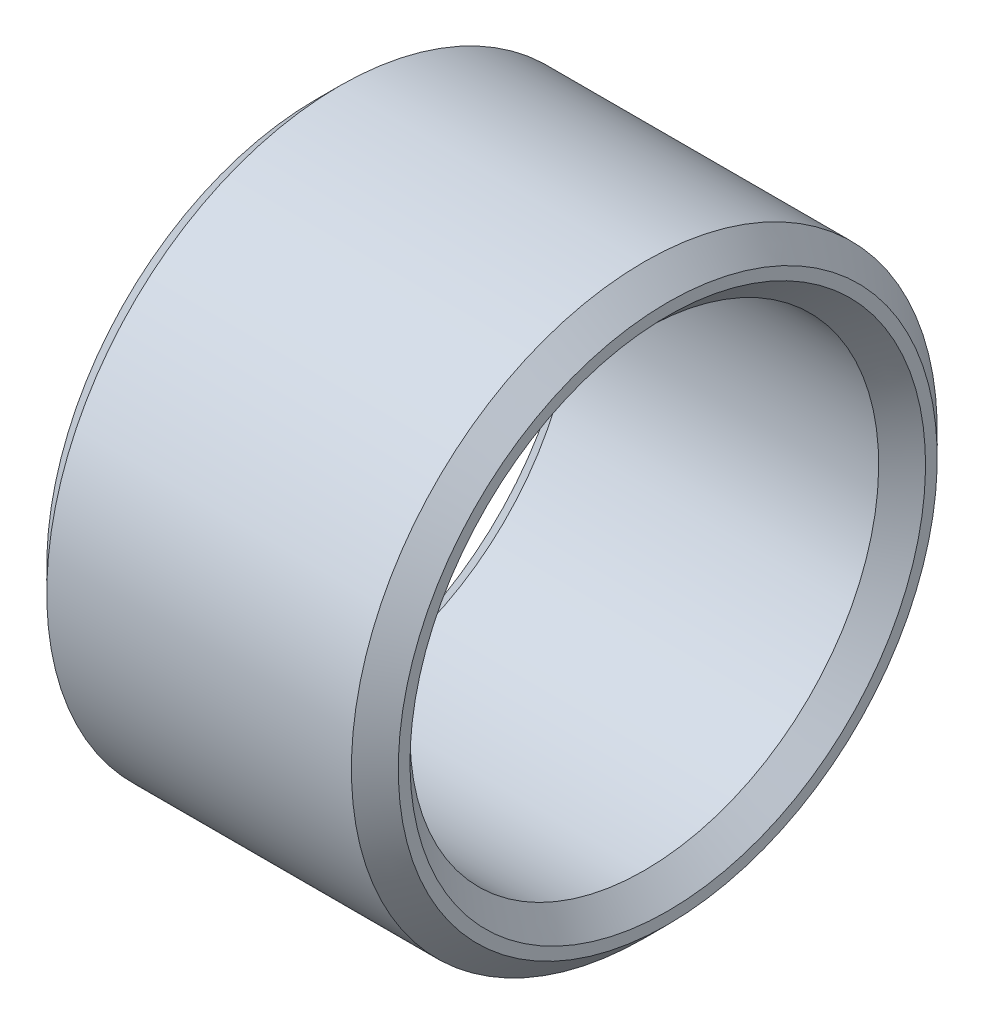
ISO-10303-21;
HEADER;
FILE_DESCRIPTION(('STEP AP214'),'2;1');
FILE_NAME('part.step','',(''),(''),'','','');
FILE_SCHEMA(('AUTOMOTIVE_DESIGN { 1 0 10303 214 1 1 1 1 }'));
ENDSEC;
DATA;
#1=APPLICATION_CONTEXT('core data for automotive mechanical design processes');
#2=APPLICATION_PROTOCOL_DEFINITION('international standard','automotive_design',2000,#1);
#3=PRODUCT_CONTEXT('',#1,'mechanical');
#4=PRODUCT('Part','Part','',(#3));
#5=PRODUCT_RELATED_PRODUCT_CATEGORY('part','',(#4));
#6=PRODUCT_DEFINITION_FORMATION('','',#4);
#7=PRODUCT_DEFINITION_CONTEXT('part definition',#1,'design');
#8=PRODUCT_DEFINITION('design','',#6,#7);
#9=PRODUCT_DEFINITION_SHAPE('','',#8);
#10=(LENGTH_UNIT() NAMED_UNIT(*) SI_UNIT(.MILLI.,.METRE.));
#11=(NAMED_UNIT(*) PLANE_ANGLE_UNIT() SI_UNIT($,.RADIAN.));
#12=(NAMED_UNIT(*) SI_UNIT($,.STERADIAN.) SOLID_ANGLE_UNIT());
#13=UNCERTAINTY_MEASURE_WITH_UNIT(LENGTH_MEASURE(1.E-05),#10,'distance_accuracy_value','');
#14=(GEOMETRIC_REPRESENTATION_CONTEXT(3) GLOBAL_UNCERTAINTY_ASSIGNED_CONTEXT((#13)) GLOBAL_UNIT_ASSIGNED_CONTEXT((#10,
#11,#12)) REPRESENTATION_CONTEXT('',''));
#15=CARTESIAN_POINT('',(0.,0.,0.));
#16=DIRECTION('',(0.,0.,1.));
#17=DIRECTION('',(1.,0.,0.));
#18=AXIS2_PLACEMENT_3D('',#15,#16,#17);
#19=CARTESIAN_POINT('',(0.,-4.5,0.));
#20=DIRECTION('',(-1.,0.,0.));
#21=DIRECTION('',(0.,1.,0.));
#22=AXIS2_PLACEMENT_3D('',#19,#20,#21);
#23=PLANE('',#22);
#24=CARTESIAN_POINT('',(0.,0.,0.));
#25=DIRECTION('',(1.,0.,0.));
#26=DIRECTION('',(0.,-1.,0.));
#27=AXIS2_PLACEMENT_3D('',#24,#25,#26);
#28=CIRCLE('',#27,4.4);
#29=CARTESIAN_POINT('',(0.,-4.4,0.));
#30=VERTEX_POINT('',#29);
#31=EDGE_CURVE('E9',#30,#30,#28,.T.);
#32=ORIENTED_EDGE('',*,*,#31,.T.);
#33=EDGE_LOOP('',(#32));
#34=FACE_BOUND('',#33,.T.);
#35=CARTESIAN_POINT('',(0.,0.,0.));
#36=DIRECTION('',(1.,0.,0.));
#37=DIRECTION('',(0.,-1.,0.));
#38=AXIS2_PLACEMENT_3D('',#35,#36,#37);
#39=CIRCLE('',#38,4.6);
#40=CARTESIAN_POINT('',(0.,-4.6,0.));
#41=VERTEX_POINT('',#40);
#42=EDGE_CURVE('E59',#41,#41,#39,.T.);
#43=ORIENTED_EDGE('',*,*,#42,.F.);
#44=EDGE_LOOP('',(#43));
#45=FACE_BOUND('',#44,.T.);
#46=ADVANCED_FACE('F15',(#34,#45),#23,.T.);
#47=CARTESIAN_POINT('',(0.2,0.,0.));
#48=DIRECTION('',(-1.,0.,0.));
#49=DIRECTION('',(0.,-1.,0.));
#50=AXIS2_PLACEMENT_3D('',#47,#48,#49);
#51=CONICAL_SURFACE('',#50,4.2,0.785398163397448);
#52=CARTESIAN_POINT('',(0.4,0.,0.));
#53=DIRECTION('',(1.,0.,0.));
#54=DIRECTION('',(0.,-1.,0.));
#55=AXIS2_PLACEMENT_3D('',#52,#53,#54);
#56=CIRCLE('',#55,4.);
#57=CARTESIAN_POINT('',(0.4,-4.,0.));
#58=VERTEX_POINT('',#57);
#59=EDGE_CURVE('E24',#58,#58,#56,.T.);
#60=ORIENTED_EDGE('',*,*,#59,.T.);
#61=EDGE_LOOP('',(#60));
#62=FACE_BOUND('',#61,.T.);
#63=ORIENTED_EDGE('',*,*,#31,.F.);
#64=EDGE_LOOP('',(#63));
#65=FACE_BOUND('',#64,.T.);
#66=ADVANCED_FACE('F81',(#62,#65),#51,.F.);
#67=CARTESIAN_POINT('',(3.,0.,0.));
#68=DIRECTION('',(-1.,0.,0.));
#69=DIRECTION('',(0.,-1.,0.));
#70=AXIS2_PLACEMENT_3D('',#67,#68,#69);
#71=CYLINDRICAL_SURFACE('',#70,4.);
#72=CARTESIAN_POINT('',(5.6,0.,0.));
#73=DIRECTION('',(1.,0.,0.));
#74=DIRECTION('',(0.,-1.,0.));
#75=AXIS2_PLACEMENT_3D('',#72,#73,#74);
#76=CIRCLE('',#75,4.);
#77=CARTESIAN_POINT('',(5.6,-4.,0.));
#78=VERTEX_POINT('',#77);
#79=EDGE_CURVE('E37',#78,#78,#76,.T.);
#80=ORIENTED_EDGE('',*,*,#79,.T.);
#81=EDGE_LOOP('',(#80));
#82=FACE_BOUND('',#81,.T.);
#83=ORIENTED_EDGE('',*,*,#59,.F.);
#84=EDGE_LOOP('',(#83));
#85=FACE_BOUND('',#84,.T.);
#86=ADVANCED_FACE('F85',(#82,#85),#71,.F.);
#87=CARTESIAN_POINT('',(5.8,0.,0.));
#88=DIRECTION('',(1.,0.,0.));
#89=DIRECTION('',(0.,-1.,0.));
#90=AXIS2_PLACEMENT_3D('',#87,#88,#89);
#91=CONICAL_SURFACE('',#90,4.2,0.78539816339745);
#92=CARTESIAN_POINT('',(6.,0.,0.));
#93=DIRECTION('',(1.,0.,0.));
#94=DIRECTION('',(0.,-1.,0.));
#95=AXIS2_PLACEMENT_3D('',#92,#93,#94);
#96=CIRCLE('',#95,4.4);
#97=CARTESIAN_POINT('',(6.,-4.4,0.));
#98=VERTEX_POINT('',#97);
#99=EDGE_CURVE('E42',#98,#98,#96,.T.);
#100=ORIENTED_EDGE('',*,*,#99,.T.);
#101=EDGE_LOOP('',(#100));
#102=FACE_BOUND('',#101,.T.);
#103=ORIENTED_EDGE('',*,*,#79,.F.);
#104=EDGE_LOOP('',(#103));
#105=FACE_BOUND('',#104,.T.);
#106=ADVANCED_FACE('F94',(#102,#105),#91,.F.);
#107=CARTESIAN_POINT('',(6.,-4.5,0.));
#108=DIRECTION('',(1.,0.,0.));
#109=DIRECTION('',(0.,-1.,0.));
#110=AXIS2_PLACEMENT_3D('',#107,#108,#109);
#111=PLANE('',#110);
#112=CARTESIAN_POINT('',(6.,0.,0.));
#113=DIRECTION('',(1.,0.,0.));
#114=DIRECTION('',(0.,-1.,0.));
#115=AXIS2_PLACEMENT_3D('',#112,#113,#114);
#116=CIRCLE('',#115,4.6);
#117=CARTESIAN_POINT('',(6.,-4.6,0.));
#118=VERTEX_POINT('',#117);
#119=EDGE_CURVE('E58',#118,#118,#116,.T.);
#120=ORIENTED_EDGE('',*,*,#119,.T.);
#121=EDGE_LOOP('',(#120));
#122=FACE_BOUND('',#121,.T.);
#123=ORIENTED_EDGE('',*,*,#99,.F.);
#124=EDGE_LOOP('',(#123));
#125=FACE_BOUND('',#124,.T.);
#126=ADVANCED_FACE('F90',(#122,#125),#111,.T.);
#127=CARTESIAN_POINT('',(5.8,0.,0.));
#128=DIRECTION('',(-1.,0.,0.));
#129=DIRECTION('',(0.,-1.,0.));
#130=AXIS2_PLACEMENT_3D('',#127,#128,#129);
#131=CONICAL_SURFACE('',#130,4.8,0.785398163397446);
#132=CARTESIAN_POINT('',(5.6,0.,0.));
#133=DIRECTION('',(1.,0.,0.));
#134=DIRECTION('',(0.,-1.,0.));
#135=AXIS2_PLACEMENT_3D('',#132,#133,#134);
#136=CIRCLE('',#135,5.);
#137=CARTESIAN_POINT('',(5.6,-5.,0.));
#138=VERTEX_POINT('',#137);
#139=EDGE_CURVE('E54',#138,#138,#136,.T.);
#140=ORIENTED_EDGE('',*,*,#139,.T.);
#141=EDGE_LOOP('',(#140));
#142=FACE_BOUND('',#141,.T.);
#143=ORIENTED_EDGE('',*,*,#119,.F.);
#144=EDGE_LOOP('',(#143));
#145=FACE_BOUND('',#144,.T.);
#146=ADVANCED_FACE('F55',(#142,#145),#131,.T.);
#147=CARTESIAN_POINT('',(3.,0.,0.));
#148=DIRECTION('',(-1.,0.,0.));
#149=DIRECTION('',(0.,-1.,0.));
#150=AXIS2_PLACEMENT_3D('',#147,#148,#149);
#151=CYLINDRICAL_SURFACE('',#150,5.);
#152=CARTESIAN_POINT('',(0.4,0.,0.));
#153=DIRECTION('',(1.,0.,0.));
#154=DIRECTION('',(0.,-1.,0.));
#155=AXIS2_PLACEMENT_3D('',#152,#153,#154);
#156=CIRCLE('',#155,5.);
#157=CARTESIAN_POINT('',(0.4,-5.,0.));
#158=VERTEX_POINT('',#157);
#159=EDGE_CURVE('E62',#158,#158,#156,.T.);
#160=ORIENTED_EDGE('',*,*,#159,.T.);
#161=EDGE_LOOP('',(#160));
#162=FACE_BOUND('',#161,.T.);
#163=ORIENTED_EDGE('',*,*,#139,.F.);
#164=EDGE_LOOP('',(#163));
#165=FACE_BOUND('',#164,.T.);
#166=ADVANCED_FACE('F17',(#162,#165),#151,.T.);
#167=CARTESIAN_POINT('',(0.2,0.,0.));
#168=DIRECTION('',(1.,0.,0.));
#169=DIRECTION('',(0.,-1.,0.));
#170=AXIS2_PLACEMENT_3D('',#167,#168,#169);
#171=CONICAL_SURFACE('',#170,4.8,0.785398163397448);
#172=ORIENTED_EDGE('',*,*,#42,.T.);
#173=EDGE_LOOP('',(#172));
#174=FACE_BOUND('',#173,.T.);
#175=ORIENTED_EDGE('',*,*,#159,.F.);
#176=EDGE_LOOP('',(#175));
#177=FACE_BOUND('',#176,.T.);
#178=ADVANCED_FACE('F70',(#174,#177),#171,.T.);
#179=CLOSED_SHELL('',(#46,#66,#86,#106,#126,#146,#166,#178));
#180=MANIFOLD_SOLID_BREP('B1',#179);
#181=ADVANCED_BREP_SHAPE_REPRESENTATION('',(#18,#180),#14);
#182=SHAPE_DEFINITION_REPRESENTATION(#9,#181);
ENDSEC;
END-ISO-10303-21;
